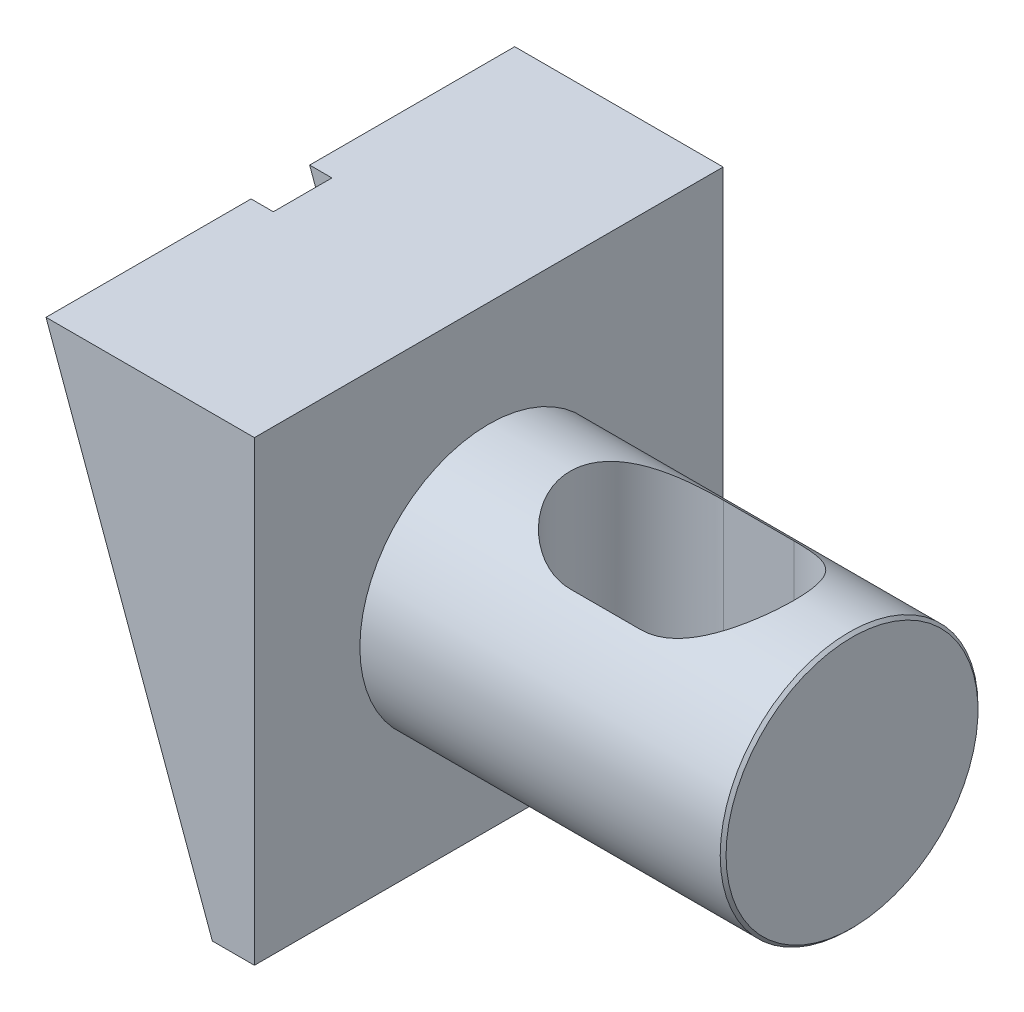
from build123d import *

# Parameters (mm, degrees)
EXTRUDE1_DEPTH          = 40
EXTRUDE1_DEPTH_BACK     = 40
CUT_EXTRUDE1_DEPTH      = 80
CUT_EXTRUDE2_DEPTH      = 5
CUT_EXTRUDE2_DEPTH_BACK = 5
SKETCH5_W               = 25
SKETCH5_H               = 13
SKETCH6_W               = 25
SKETCH6_H               = 10
CUT_EXTRUDE3_DEPTH      = 3


with BuildPart() as part:
    # Sketch1 → Revolve1 (revolve)
    with BuildSketch(Plane.XY, mode=Mode.PRIVATE) as revolve1_sk:
        Polygon((-62, 38), (-62, 60), (-0.5, 60), (0, 59.5), (0, 38), align=None)
    revolve(revolve1_sk.sketch.rotate(Axis((0, 38, 0), (-1, 0, 0)), 270), axis=Axis((0, 38, 0), (-1, 0, 0)))

    # Sketch2 → Extrude1 (add, two sides: drawn at the far end of the back side and taken through both)
    with BuildSketch(Plane.XY.offset(-EXTRUDE1_DEPTH_BACK)):
        Polygon((-97.572059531, 78), (-69.182381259, 0), (-62, 0), (-62, 78), align=None)
    extrude(amount=EXTRUDE1_DEPTH + EXTRUDE1_DEPTH_BACK)

    # Sketch3 → Cut-Extrude1 (cut)
    with BuildSketch(Plane(origin=(0, 0, 0), x_dir=(-1, 0, 0), z_dir=(0, 1, 0))):
        with BuildLine():
            Line((35, 13.1), (23, 13.1))
            ThreePointArc((23, 13.1), (9.9, 0), (23, -13.1))
            Line((23, -13.1), (35, -13.1))
            ThreePointArc((35, -13.1), (48.1, 0), (35, 13.1))
        make_face()
    extrude(amount=CUT_EXTRUDE1_DEPTH, mode=Mode.SUBTRACT)

    # Sketch4 → Cut-Extrude2 (cut, two sides: drawn at the far end of the back side and taken through both)
    with BuildSketch(Plane.XY.offset(-CUT_EXTRUDE2_DEPTH_BACK)):
        Polygon((-106, 0), (-65.382381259, 0), (-93.772059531, 78), (-106, 78), align=None)
    extrude(amount=CUT_EXTRUDE2_DEPTH + CUT_EXTRUDE2_DEPTH_BACK, mode=Mode.SUBTRACT)

    # Sketch5 → Cut-Revolve1 (revolve, cut)
    with BuildSketch(Plane.XY, mode=Mode.PRIVATE) as cut_revolve1_sk:
        with Locations((-81.4, 44.5)):
            Rectangle(SKETCH5_W, SKETCH5_H)
    revolve(cut_revolve1_sk.sketch.rotate(Axis((-68.9, 38, 0), (-1, 0, 0)), 270), axis=Axis((-68.9, 38, 0), (-1, 0, 0)), mode=Mode.SUBTRACT)

    # Sketch6 → Revolve2 (revolve)
    with BuildSketch(Plane.XY, mode=Mode.PRIVATE) as revolve2_sk:
        with Locations((-81.4, 43)):
            Rectangle(SKETCH6_W, SKETCH6_H)
    revolve(revolve2_sk.sketch.rotate(Axis((-68.9, 38, 0), (-1, 0, 0)), 270), axis=Axis((-68.9, 38, 0), (-1, 0, 0)))

    # Sketch7 → Revolve3 (revolve)
    with BuildSketch(Plane.XY, mode=Mode.PRIVATE) as revolve3_sk:
        with BuildLine():
            Line((-105.8, 38), (-105.8, 42.5))
            ThreePointArc((-105.8, 42.5), (-105.653553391, 42.853553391), (-105.3, 43))
            Line((-105.3, 43), (-101.8, 43))
            Line((-101.8, 43), (-101.8, 41))
            Line((-101.8, 41), (-92.4135, 41))
            Line((-92.4135, 41), (-91.8, 40.3865))
            Line((-91.8, 40.3865), (-91.8, 38))
            Line((-91.8, 38), (-105.8, 38))
        make_face()
    revolve(revolve3_sk.sketch.rotate(Axis((-91.8, 38, 0), (-1, 0, 0)), 270), axis=Axis((-91.8, 38, 0), (-1, 0, 0)))

    # Sketch8 → Cut-Extrude3 (cut)
    with BuildSketch(Plane.ZY.offset(105.8)):
        Polygon((-1.443375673, 35.5), (1.443375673, 35.5), (2.886751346, 38), (1.443375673, 40.5), (-1.443375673, 40.5), (-2.886751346, 38), align=None)
    extrude(amount=-CUT_EXTRUDE3_DEPTH, mode=Mode.SUBTRACT)


solid = part.part
